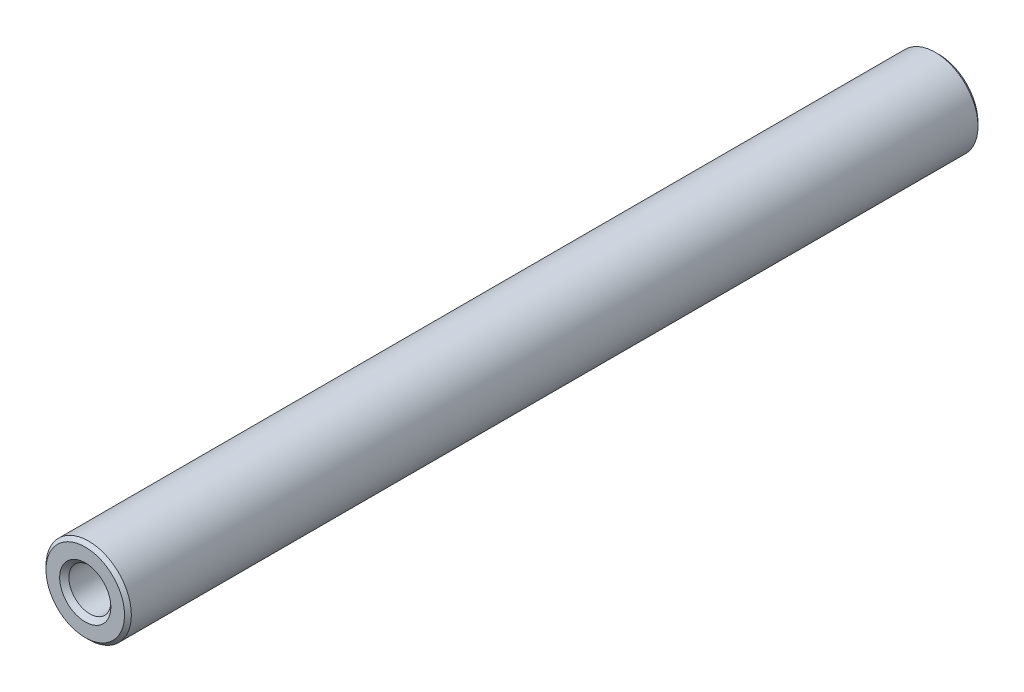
ISO-10303-21;
HEADER;
FILE_DESCRIPTION(('STEP AP214'),'2;1');
FILE_NAME('part.step','',(''),(''),'','','');
FILE_SCHEMA(('AUTOMOTIVE_DESIGN { 1 0 10303 214 1 1 1 1 }'));
ENDSEC;
DATA;
#1=APPLICATION_CONTEXT('core data for automotive mechanical design processes');
#2=APPLICATION_PROTOCOL_DEFINITION('international standard','automotive_design',2000,#1);
#3=PRODUCT_CONTEXT('',#1,'mechanical');
#4=PRODUCT('Part','Part','',(#3));
#5=PRODUCT_RELATED_PRODUCT_CATEGORY('part','',(#4));
#6=PRODUCT_DEFINITION_FORMATION('','',#4);
#7=PRODUCT_DEFINITION_CONTEXT('part definition',#1,'design');
#8=PRODUCT_DEFINITION('design','',#6,#7);
#9=PRODUCT_DEFINITION_SHAPE('','',#8);
#10=(LENGTH_UNIT() NAMED_UNIT(*) SI_UNIT(.MILLI.,.METRE.));
#11=(NAMED_UNIT(*) PLANE_ANGLE_UNIT() SI_UNIT($,.RADIAN.));
#12=(NAMED_UNIT(*) SI_UNIT($,.STERADIAN.) SOLID_ANGLE_UNIT());
#13=UNCERTAINTY_MEASURE_WITH_UNIT(LENGTH_MEASURE(1.E-05),#10,'distance_accuracy_value','');
#14=(GEOMETRIC_REPRESENTATION_CONTEXT(3) GLOBAL_UNCERTAINTY_ASSIGNED_CONTEXT((#13)) GLOBAL_UNIT_ASSIGNED_CONTEXT((#10,
#11,#12)) REPRESENTATION_CONTEXT('',''));
#15=CARTESIAN_POINT('',(0.,0.,0.));
#16=DIRECTION('',(0.,0.,1.));
#17=DIRECTION('',(1.,0.,0.));
#18=AXIS2_PLACEMENT_3D('',#15,#16,#17);
#19=CARTESIAN_POINT('',(0.,0.,-5.99999999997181));
#20=DIRECTION('',(0.,0.,1.));
#21=DIRECTION('',(1.,0.,0.));
#22=AXIS2_PLACEMENT_3D('',#19,#20,#21);
#23=CONICAL_SURFACE('',#22,1.2295000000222,1.04719755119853);
#24=CARTESIAN_POINT('',(0.,0.,-6.7098521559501));
#25=VERTEX_POINT('',#24);
#26=VERTEX_LOOP('',#25);
#27=FACE_BOUND('',#26,.T.);
#28=CARTESIAN_POINT('',(0.,0.,-6.));
#29=DIRECTION('',(0.,0.,1.));
#30=DIRECTION('',(1.,0.,0.));
#31=AXIS2_PLACEMENT_3D('',#28,#29,#30);
#32=CIRCLE('',#31,1.2295);
#33=CARTESIAN_POINT('',(1.2295,0.,-6.));
#34=VERTEX_POINT('',#33);
#35=EDGE_CURVE('E32',#34,#34,#32,.T.);
#36=ORIENTED_EDGE('',*,*,#35,.T.);
#37=EDGE_LOOP('',(#36));
#38=FACE_BOUND('',#37,.T.);
#39=ADVANCED_FACE('F16',(#27,#38),#23,.F.);
#40=CARTESIAN_POINT('',(0.,0.,-6.70985215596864));
#41=DIRECTION('',(0.,0.,1.));
#42=DIRECTION('',(1.,0.,0.));
#43=AXIS2_PLACEMENT_3D('',#40,#41,#42);
#44=CYLINDRICAL_SURFACE('',#43,1.2295);
#45=CARTESIAN_POINT('',(0.,0.,-0.270499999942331));
#46=DIRECTION('',(0.,0.,1.));
#47=DIRECTION('',(1.,0.,0.));
#48=AXIS2_PLACEMENT_3D('',#45,#46,#47);
#49=CIRCLE('',#48,1.2295000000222);
#50=CARTESIAN_POINT('',(1.2295000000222,0.,-0.270499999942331));
#51=VERTEX_POINT('',#50);
#52=EDGE_CURVE('E34',#51,#51,#49,.T.);
#53=ORIENTED_EDGE('',*,*,#52,.T.);
#54=EDGE_LOOP('',(#53));
#55=FACE_BOUND('',#54,.T.);
#56=ORIENTED_EDGE('',*,*,#35,.F.);
#57=EDGE_LOOP('',(#56));
#58=FACE_BOUND('',#57,.T.);
#59=ADVANCED_FACE('F29',(#55,#58),#44,.F.);
#60=CARTESIAN_POINT('',(0.,0.,-1.13686837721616E-10));
#61=DIRECTION('',(0.,0.,1.));
#62=DIRECTION('',(1.,0.,0.));
#63=AXIS2_PLACEMENT_3D('',#60,#61,#62);
#64=CONICAL_SURFACE('',#63,1.49999999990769,0.785398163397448);
#65=CARTESIAN_POINT('',(0.,0.,-5.6843418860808E-11));
#66=DIRECTION('',(0.,0.,1.));
#67=DIRECTION('',(1.,0.,0.));
#68=AXIS2_PLACEMENT_3D('',#65,#66,#67);
#69=CIRCLE('',#68,1.49999999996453);
#70=CARTESIAN_POINT('',(1.49999999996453,0.,-5.6843418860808E-11));
#71=VERTEX_POINT('',#70);
#72=EDGE_CURVE('E19',#71,#71,#69,.T.);
#73=ORIENTED_EDGE('',*,*,#72,.T.);
#74=EDGE_LOOP('',(#73));
#75=FACE_BOUND('',#74,.T.);
#76=ORIENTED_EDGE('',*,*,#52,.F.);
#77=EDGE_LOOP('',(#76));
#78=FACE_BOUND('',#77,.T.);
#79=ADVANCED_FACE('F52',(#75,#78),#64,.F.);
#80=CARTESIAN_POINT('',(0.,2.3,-50.));
#81=DIRECTION('',(0.,0.,1.));
#82=DIRECTION('',(1.,0.,0.));
#83=AXIS2_PLACEMENT_3D('',#80,#81,#82);
#84=PLANE('',#83);
#85=CARTESIAN_POINT('',(0.,0.,-50.0000000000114));
#86=DIRECTION('',(0.,0.,1.));
#87=DIRECTION('',(0.,-1.,0.));
#88=AXIS2_PLACEMENT_3D('',#85,#86,#87);
#89=CIRCLE('',#88,2.29999999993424);
#90=CARTESIAN_POINT('',(0.,-2.29999999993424,-50.0000000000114));
#91=VERTEX_POINT('',#90);
#92=EDGE_CURVE('E45',#91,#91,#89,.T.);
#93=ORIENTED_EDGE('',*,*,#92,.F.);
#94=EDGE_LOOP('',(#93));
#95=FACE_BOUND('',#94,.T.);
#96=ADVANCED_FACE('F59',(#95),#84,.F.);
#97=CARTESIAN_POINT('',(0.,0.,0.));
#98=DIRECTION('',(0.,0.,-1.));
#99=DIRECTION('',(-1.,0.,0.));
#100=AXIS2_PLACEMENT_3D('',#97,#98,#99);
#101=PLANE('',#100);
#102=ORIENTED_EDGE('',*,*,#72,.F.);
#103=EDGE_LOOP('',(#102));
#104=FACE_BOUND('',#103,.T.);
#105=CARTESIAN_POINT('',(0.,0.,0.));
#106=DIRECTION('',(0.,0.,-1.));
#107=DIRECTION('',(-1.,0.,0.));
#108=AXIS2_PLACEMENT_3D('',#105,#106,#107);
#109=CIRCLE('',#108,2.29999999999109);
#110=CARTESIAN_POINT('',(-2.29999999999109,0.,0.));
#111=VERTEX_POINT('',#110);
#112=EDGE_CURVE('E43',#111,#111,#109,.T.);
#113=ORIENTED_EDGE('',*,*,#112,.F.);
#114=EDGE_LOOP('',(#113));
#115=FACE_BOUND('',#114,.T.);
#116=ADVANCED_FACE('F55',(#104,#115),#101,.F.);
#117=CARTESIAN_POINT('',(0.,0.,-49.8000000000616));
#118=DIRECTION('',(0.,0.,1.));
#119=DIRECTION('',(0.,-1.,0.));
#120=AXIS2_PLACEMENT_3D('',#117,#118,#119);
#121=CONICAL_SURFACE('',#120,2.49999999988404,0.785398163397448);
#122=CARTESIAN_POINT('',(0.,0.,-49.8));
#123=DIRECTION('',(0.,0.,1.));
#124=DIRECTION('',(1.,0.,0.));
#125=AXIS2_PLACEMENT_3D('',#122,#123,#124);
#126=CIRCLE('',#125,2.5);
#127=CARTESIAN_POINT('',(2.5,0.,-49.8));
#128=VERTEX_POINT('',#127);
#129=EDGE_CURVE('E23',#128,#128,#126,.T.);
#130=ORIENTED_EDGE('',*,*,#129,.F.);
#131=EDGE_LOOP('',(#130));
#132=FACE_BOUND('',#131,.T.);
#133=ORIENTED_EDGE('',*,*,#92,.T.);
#134=EDGE_LOOP('',(#133));
#135=FACE_BOUND('',#134,.T.);
#136=ADVANCED_FACE('F58',(#132,#135),#121,.T.);
#137=CARTESIAN_POINT('',(0.,0.,-0.20000000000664));
#138=DIRECTION('',(0.,0.,-1.));
#139=DIRECTION('',(-1.,0.,0.));
#140=AXIS2_PLACEMENT_3D('',#137,#138,#139);
#141=CONICAL_SURFACE('',#140,2.49999999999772,0.785398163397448);
#142=ORIENTED_EDGE('',*,*,#112,.T.);
#143=EDGE_LOOP('',(#142));
#144=FACE_BOUND('',#143,.T.);
#145=CARTESIAN_POINT('',(0.,0.,-0.2));
#146=DIRECTION('',(0.,0.,1.));
#147=DIRECTION('',(1.,0.,0.));
#148=AXIS2_PLACEMENT_3D('',#145,#146,#147);
#149=CIRCLE('',#148,2.5);
#150=CARTESIAN_POINT('',(2.5,0.,-0.2));
#151=VERTEX_POINT('',#150);
#152=EDGE_CURVE('E11',#151,#151,#149,.F.);
#153=ORIENTED_EDGE('',*,*,#152,.F.);
#154=EDGE_LOOP('',(#153));
#155=FACE_BOUND('',#154,.T.);
#156=ADVANCED_FACE('F63',(#144,#155),#141,.T.);
#157=CARTESIAN_POINT('',(0.,0.,-50.));
#158=DIRECTION('',(0.,0.,1.));
#159=DIRECTION('',(1.,0.,0.));
#160=AXIS2_PLACEMENT_3D('',#157,#158,#159);
#161=CYLINDRICAL_SURFACE('',#160,2.5);
#162=ORIENTED_EDGE('',*,*,#152,.T.);
#163=EDGE_LOOP('',(#162));
#164=FACE_BOUND('',#163,.T.);
#165=ORIENTED_EDGE('',*,*,#129,.T.);
#166=EDGE_LOOP('',(#165));
#167=FACE_BOUND('',#166,.T.);
#168=ADVANCED_FACE('F66',(#164,#167),#161,.T.);
#169=CLOSED_SHELL('',(#39,#59,#79,#96,#116,#136,#156,#168));
#170=MANIFOLD_SOLID_BREP('B1',#169);
#171=ADVANCED_BREP_SHAPE_REPRESENTATION('',(#18,#170),#14);
#172=SHAPE_DEFINITION_REPRESENTATION(#9,#171);
ENDSEC;
END-ISO-10303-21;
